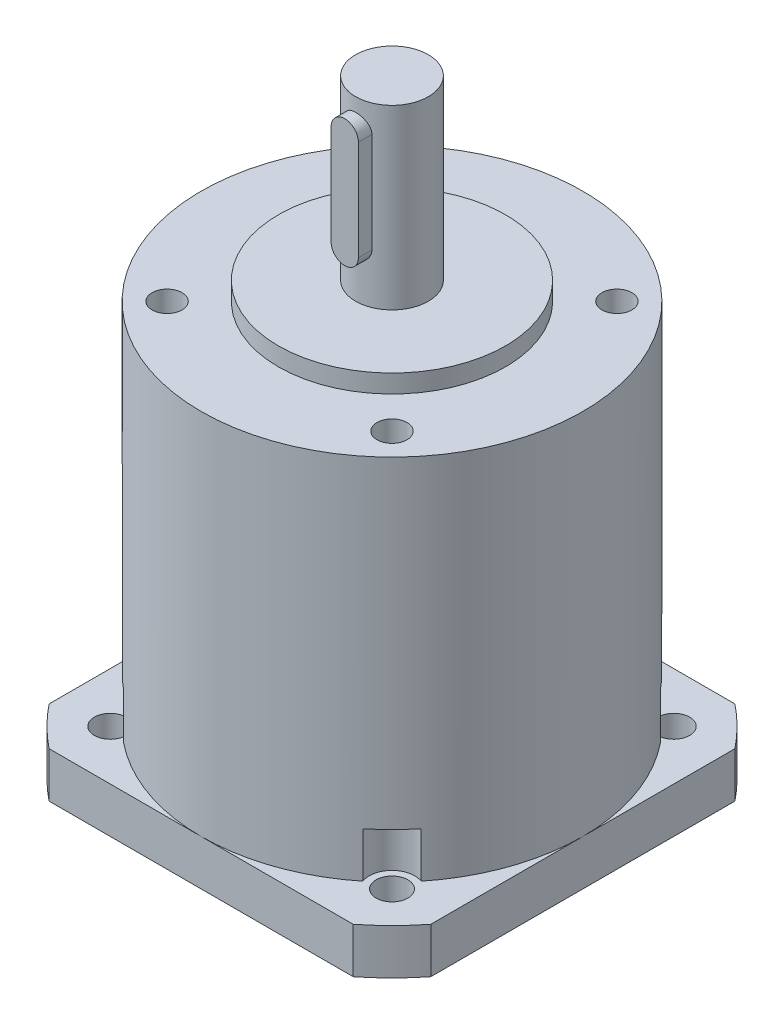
ISO-10303-21;
HEADER;
FILE_DESCRIPTION(('STEP AP214'),'2;1');
FILE_NAME('part.step','',(''),(''),'','','');
FILE_SCHEMA(('AUTOMOTIVE_DESIGN { 1 0 10303 214 1 1 1 1 }'));
ENDSEC;
DATA;
#1=APPLICATION_CONTEXT('core data for automotive mechanical design processes');
#2=APPLICATION_PROTOCOL_DEFINITION('international standard','automotive_design',2000,#1);
#3=PRODUCT_CONTEXT('',#1,'mechanical');
#4=PRODUCT('Part','Part','',(#3));
#5=PRODUCT_RELATED_PRODUCT_CATEGORY('part','',(#4));
#6=PRODUCT_DEFINITION_FORMATION('','',#4);
#7=PRODUCT_DEFINITION_CONTEXT('part definition',#1,'design');
#8=PRODUCT_DEFINITION('design','',#6,#7);
#9=PRODUCT_DEFINITION_SHAPE('','',#8);
#10=(LENGTH_UNIT() NAMED_UNIT(*) SI_UNIT(.MILLI.,.METRE.));
#11=(NAMED_UNIT(*) PLANE_ANGLE_UNIT() SI_UNIT($,.RADIAN.));
#12=(NAMED_UNIT(*) SI_UNIT($,.STERADIAN.) SOLID_ANGLE_UNIT());
#13=UNCERTAINTY_MEASURE_WITH_UNIT(LENGTH_MEASURE(1.E-05),#10,'distance_accuracy_value','');
#14=(GEOMETRIC_REPRESENTATION_CONTEXT(3) GLOBAL_UNCERTAINTY_ASSIGNED_CONTEXT((#13)) GLOBAL_UNIT_ASSIGNED_CONTEXT((#10,
#11,#12)) REPRESENTATION_CONTEXT('',''));
#15=CARTESIAN_POINT('',(0.,0.,0.));
#16=DIRECTION('',(0.,0.,1.));
#17=DIRECTION('',(1.,0.,0.));
#18=AXIS2_PLACEMENT_3D('',#15,#16,#17);
#19=CARTESIAN_POINT('',(0.,40.5,0.));
#20=DIRECTION('',(0.,-1.,0.));
#21=DIRECTION('',(0.,0.,-1.));
#22=AXIS2_PLACEMENT_3D('',#19,#20,#21);
#23=CYLINDRICAL_SURFACE('',#22,21.);
#24=CARTESIAN_POINT('',(0.,40.5,0.));
#25=DIRECTION('',(0.,1.,0.));
#26=DIRECTION('',(0.,0.,1.));
#27=AXIS2_PLACEMENT_3D('',#24,#25,#26);
#28=CIRCLE('',#27,21.);
#29=CARTESIAN_POINT('',(0.,40.5,21.));
#30=VERTEX_POINT('',#29);
#31=EDGE_CURVE('E235',#30,#30,#28,.T.);
#32=ORIENTED_EDGE('',*,*,#31,.F.);
#33=EDGE_LOOP('',(#32));
#34=FACE_BOUND('',#33,.T.);
#35=DIRECTION('',(0.,-1.,0.));
#36=VECTOR('',#35,1.);
#37=CARTESIAN_POINT('',(16.3684898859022,2.5,-13.1557036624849));
#38=LINE('',#37,#36);
#39=CARTESIAN_POINT('',(16.3684898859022,5.,-13.1557036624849));
#40=VERTEX_POINT('',#39);
#41=CARTESIAN_POINT('',(16.3684898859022,0.,-13.1557036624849));
#42=VERTEX_POINT('',#41);
#43=EDGE_CURVE('E199',#40,#42,#38,.T.);
#44=ORIENTED_EDGE('',*,*,#43,.F.);
#45=CARTESIAN_POINT('',(0.,5.,0.));
#46=DIRECTION('',(0.,-1.,0.));
#47=DIRECTION('',(0.,0.,-1.));
#48=AXIS2_PLACEMENT_3D('',#45,#46,#47);
#49=CIRCLE('',#48,21.);
#50=CARTESIAN_POINT('',(13.1557036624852,5.,-16.3684898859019));
#51=VERTEX_POINT('',#50);
#52=EDGE_CURVE('E314',#51,#40,#49,.T.);
#53=ORIENTED_EDGE('',*,*,#52,.F.);
#54=DIRECTION('',(0.,-1.,0.));
#55=VECTOR('',#54,1.);
#56=CARTESIAN_POINT('',(13.1557036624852,2.5,-16.3684898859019));
#57=LINE('',#56,#55);
#58=CARTESIAN_POINT('',(13.1557036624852,0.,-16.3684898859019));
#59=VERTEX_POINT('',#58);
#60=EDGE_CURVE('E210',#59,#51,#57,.F.);
#61=ORIENTED_EDGE('',*,*,#60,.F.);
#62=CARTESIAN_POINT('',(0.,0.,0.));
#63=DIRECTION('',(0.,1.,0.));
#64=DIRECTION('',(0.,0.,1.));
#65=AXIS2_PLACEMENT_3D('',#62,#63,#64);
#66=CIRCLE('',#65,21.);
#67=CARTESIAN_POINT('',(0.,0.,-21.));
#68=VERTEX_POINT('',#67);
#69=EDGE_CURVE('E220',#59,#68,#66,.T.);
#70=ORIENTED_EDGE('',*,*,#69,.T.);
#71=CARTESIAN_POINT('',(-13.155703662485,0.,-16.3684898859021));
#72=VERTEX_POINT('',#71);
#73=EDGE_CURVE('E228',#68,#72,#66,.T.);
#74=ORIENTED_EDGE('',*,*,#73,.T.);
#75=DIRECTION('',(0.,-1.,0.));
#76=VECTOR('',#75,1.);
#77=CARTESIAN_POINT('',(-13.155703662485,2.5,-16.3684898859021));
#78=LINE('',#77,#76);
#79=CARTESIAN_POINT('',(-13.155703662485,5.,-16.3684898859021));
#80=VERTEX_POINT('',#79);
#81=EDGE_CURVE('E606',#80,#72,#78,.T.);
#82=ORIENTED_EDGE('',*,*,#81,.F.);
#83=CARTESIAN_POINT('',(0.,5.,0.));
#84=DIRECTION('',(0.,-1.,0.));
#85=DIRECTION('',(0.,0.,-1.));
#86=AXIS2_PLACEMENT_3D('',#83,#84,#85);
#87=CIRCLE('',#86,21.);
#88=CARTESIAN_POINT('',(-16.3684898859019,5.,-13.1557036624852));
#89=VERTEX_POINT('',#88);
#90=EDGE_CURVE('E316',#89,#80,#87,.T.);
#91=ORIENTED_EDGE('',*,*,#90,.F.);
#92=DIRECTION('',(0.,-1.,0.));
#93=VECTOR('',#92,1.);
#94=CARTESIAN_POINT('',(-16.3684898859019,2.5,-13.1557036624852));
#95=LINE('',#94,#93);
#96=CARTESIAN_POINT('',(-16.3684898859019,0.,-13.1557036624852));
#97=VERTEX_POINT('',#96);
#98=EDGE_CURVE('E610',#97,#89,#95,.F.);
#99=ORIENTED_EDGE('',*,*,#98,.F.);
#100=CARTESIAN_POINT('',(-21.,0.,0.));
#101=VERTEX_POINT('',#100);
#102=EDGE_CURVE('E231',#97,#101,#66,.T.);
#103=ORIENTED_EDGE('',*,*,#102,.T.);
#104=CARTESIAN_POINT('',(-16.3684898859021,0.,13.155703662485));
#105=VERTEX_POINT('',#104);
#106=EDGE_CURVE('E229',#101,#105,#66,.T.);
#107=ORIENTED_EDGE('',*,*,#106,.T.);
#108=DIRECTION('',(0.,-1.,0.));
#109=VECTOR('',#108,1.);
#110=CARTESIAN_POINT('',(-16.3684898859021,2.5,13.155703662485));
#111=LINE('',#110,#109);
#112=CARTESIAN_POINT('',(-16.3684898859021,5.,13.155703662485));
#113=VERTEX_POINT('',#112);
#114=EDGE_CURVE('E331',#113,#105,#111,.T.);
#115=ORIENTED_EDGE('',*,*,#114,.F.);
#116=CARTESIAN_POINT('',(0.,5.,0.));
#117=DIRECTION('',(0.,-1.,0.));
#118=DIRECTION('',(0.,0.,-1.));
#119=AXIS2_PLACEMENT_3D('',#116,#117,#118);
#120=CIRCLE('',#119,21.);
#121=CARTESIAN_POINT('',(-13.1557036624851,5.,16.368489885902));
#122=VERTEX_POINT('',#121);
#123=EDGE_CURVE('E318',#122,#113,#120,.T.);
#124=ORIENTED_EDGE('',*,*,#123,.F.);
#125=DIRECTION('',(0.,-1.,0.));
#126=VECTOR('',#125,1.);
#127=CARTESIAN_POINT('',(-13.1557036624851,2.5,16.368489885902));
#128=LINE('',#127,#126);
#129=CARTESIAN_POINT('',(-13.1557036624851,0.,16.368489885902));
#130=VERTEX_POINT('',#129);
#131=EDGE_CURVE('E335',#130,#122,#128,.F.);
#132=ORIENTED_EDGE('',*,*,#131,.F.);
#133=CARTESIAN_POINT('',(0.,0.,21.));
#134=VERTEX_POINT('',#133);
#135=EDGE_CURVE('E230',#130,#134,#66,.T.);
#136=ORIENTED_EDGE('',*,*,#135,.T.);
#137=CARTESIAN_POINT('',(13.1557036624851,0.,16.368489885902));
#138=VERTEX_POINT('',#137);
#139=EDGE_CURVE('E227',#134,#138,#66,.T.);
#140=ORIENTED_EDGE('',*,*,#139,.T.);
#141=DIRECTION('',(0.,-1.,0.));
#142=VECTOR('',#141,1.);
#143=CARTESIAN_POINT('',(13.1557036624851,2.5,16.368489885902));
#144=LINE('',#143,#142);
#145=CARTESIAN_POINT('',(13.1557036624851,5.,16.368489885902));
#146=VERTEX_POINT('',#145);
#147=EDGE_CURVE('E46',#146,#138,#144,.T.);
#148=ORIENTED_EDGE('',*,*,#147,.F.);
#149=CARTESIAN_POINT('',(0.,5.,0.));
#150=DIRECTION('',(0.,-1.,0.));
#151=DIRECTION('',(0.,0.,-1.));
#152=AXIS2_PLACEMENT_3D('',#149,#150,#151);
#153=CIRCLE('',#152,21.);
#154=CARTESIAN_POINT('',(16.368489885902,5.,13.1557036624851));
#155=VERTEX_POINT('',#154);
#156=EDGE_CURVE('E307',#155,#146,#153,.T.);
#157=ORIENTED_EDGE('',*,*,#156,.F.);
#158=DIRECTION('',(0.,-1.,0.));
#159=VECTOR('',#158,1.);
#160=CARTESIAN_POINT('',(16.368489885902,2.5,13.1557036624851));
#161=LINE('',#160,#159);
#162=CARTESIAN_POINT('',(16.368489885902,0.,13.1557036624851));
#163=VERTEX_POINT('',#162);
#164=EDGE_CURVE('E11',#163,#155,#161,.F.);
#165=ORIENTED_EDGE('',*,*,#164,.F.);
#166=CARTESIAN_POINT('',(21.,0.,0.));
#167=VERTEX_POINT('',#166);
#168=EDGE_CURVE('E224',#163,#167,#66,.T.);
#169=ORIENTED_EDGE('',*,*,#168,.T.);
#170=EDGE_CURVE('E217',#167,#42,#66,.T.);
#171=ORIENTED_EDGE('',*,*,#170,.T.);
#172=EDGE_LOOP('',(#44,#53,#61,#70,#74,#82,#91,#99,#103,#107,#115,#124,#132,#136,#140,#148,#157,
#165,#169,#171));
#173=FACE_BOUND('',#172,.T.);
#174=ADVANCED_FACE('F39',(#34,#173),#23,.T.);
#175=CARTESIAN_POINT('',(15.4999999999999,5.,-15.5000000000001));
#176=DIRECTION('',(0.,-1.,0.));
#177=DIRECTION('',(0.,0.,-1.));
#178=AXIS2_PLACEMENT_3D('',#175,#176,#177);
#179=CYLINDRICAL_SURFACE('',#178,1.75);
#180=CARTESIAN_POINT('',(15.4999999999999,-5.,-15.5000000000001));
#181=DIRECTION('',(0.,-1.,0.));
#182=DIRECTION('',(0.,0.,-1.));
#183=AXIS2_PLACEMENT_3D('',#180,#181,#182);
#184=CIRCLE('',#183,1.75);
#185=CARTESIAN_POINT('',(15.4999999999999,-5.,-17.2500000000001));
#186=VERTEX_POINT('',#185);
#187=EDGE_CURVE('E349',#186,#186,#184,.T.);
#188=ORIENTED_EDGE('',*,*,#187,.T.);
#189=EDGE_LOOP('',(#188));
#190=FACE_BOUND('',#189,.T.);
#191=CARTESIAN_POINT('',(15.4999999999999,0.,-15.5000000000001));
#192=DIRECTION('',(0.,-1.,0.));
#193=DIRECTION('',(0.,0.,-1.));
#194=AXIS2_PLACEMENT_3D('',#191,#192,#193);
#195=CIRCLE('',#194,1.75);
#196=CARTESIAN_POINT('',(15.4999999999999,0.,-17.2500000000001));
#197=VERTEX_POINT('',#196);
#198=EDGE_CURVE('E352',#197,#197,#195,.T.);
#199=ORIENTED_EDGE('',*,*,#198,.F.);
#200=EDGE_LOOP('',(#199));
#201=FACE_BOUND('',#200,.T.);
#202=ADVANCED_FACE('F493',(#190,#201),#179,.F.);
#203=CARTESIAN_POINT('',(-15.5000000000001,5.,-15.4999999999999));
#204=DIRECTION('',(0.,-1.,0.));
#205=DIRECTION('',(0.,0.,-1.));
#206=AXIS2_PLACEMENT_3D('',#203,#204,#205);
#207=CYLINDRICAL_SURFACE('',#206,1.75);
#208=CARTESIAN_POINT('',(-15.5000000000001,-5.,-15.4999999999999));
#209=DIRECTION('',(0.,-1.,0.));
#210=DIRECTION('',(0.,0.,-1.));
#211=AXIS2_PLACEMENT_3D('',#208,#209,#210);
#212=CIRCLE('',#211,1.75);
#213=CARTESIAN_POINT('',(-15.5000000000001,-5.,-17.2499999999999));
#214=VERTEX_POINT('',#213);
#215=EDGE_CURVE('E343',#214,#214,#212,.T.);
#216=ORIENTED_EDGE('',*,*,#215,.T.);
#217=EDGE_LOOP('',(#216));
#218=FACE_BOUND('',#217,.T.);
#219=CARTESIAN_POINT('',(-15.5000000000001,0.,-15.4999999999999));
#220=DIRECTION('',(0.,-1.,0.));
#221=DIRECTION('',(0.,0.,-1.));
#222=AXIS2_PLACEMENT_3D('',#219,#220,#221);
#223=CIRCLE('',#222,1.75);
#224=CARTESIAN_POINT('',(-15.5000000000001,0.,-17.2499999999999));
#225=VERTEX_POINT('',#224);
#226=EDGE_CURVE('E346',#225,#225,#223,.T.);
#227=ORIENTED_EDGE('',*,*,#226,.F.);
#228=EDGE_LOOP('',(#227));
#229=FACE_BOUND('',#228,.T.);
#230=ADVANCED_FACE('F498',(#218,#229),#207,.F.);
#231=CARTESIAN_POINT('',(-15.4999999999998,5.,15.5000000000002));
#232=DIRECTION('',(0.,-1.,0.));
#233=DIRECTION('',(0.,0.,-1.));
#234=AXIS2_PLACEMENT_3D('',#231,#232,#233);
#235=CYLINDRICAL_SURFACE('',#234,1.75);
#236=CARTESIAN_POINT('',(-15.4999999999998,-5.,15.5000000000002));
#237=DIRECTION('',(0.,-1.,0.));
#238=DIRECTION('',(0.,0.,-1.));
#239=AXIS2_PLACEMENT_3D('',#236,#237,#238);
#240=CIRCLE('',#239,1.75);
#241=CARTESIAN_POINT('',(-15.4999999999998,-5.,13.7500000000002));
#242=VERTEX_POINT('',#241);
#243=EDGE_CURVE('E333',#242,#242,#240,.T.);
#244=ORIENTED_EDGE('',*,*,#243,.T.);
#245=EDGE_LOOP('',(#244));
#246=FACE_BOUND('',#245,.T.);
#247=CARTESIAN_POINT('',(-15.4999999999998,0.,15.5000000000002));
#248=DIRECTION('',(0.,-1.,0.));
#249=DIRECTION('',(0.,0.,-1.));
#250=AXIS2_PLACEMENT_3D('',#247,#248,#249);
#251=CIRCLE('',#250,1.75);
#252=CARTESIAN_POINT('',(-15.4999999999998,0.,13.7500000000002));
#253=VERTEX_POINT('',#252);
#254=EDGE_CURVE('E340',#253,#253,#251,.T.);
#255=ORIENTED_EDGE('',*,*,#254,.F.);
#256=EDGE_LOOP('',(#255));
#257=FACE_BOUND('',#256,.T.);
#258=ADVANCED_FACE('F504',(#246,#257),#235,.F.);
#259=CARTESIAN_POINT('',(15.5,5.,15.5));
#260=DIRECTION('',(0.,-1.,0.));
#261=DIRECTION('',(0.,0.,-1.));
#262=AXIS2_PLACEMENT_3D('',#259,#260,#261);
#263=CYLINDRICAL_SURFACE('',#262,1.75);
#264=CARTESIAN_POINT('',(15.5,-5.,15.5));
#265=DIRECTION('',(0.,-1.,0.));
#266=DIRECTION('',(0.,0.,-1.));
#267=AXIS2_PLACEMENT_3D('',#264,#265,#266);
#268=CIRCLE('',#267,1.75);
#269=CARTESIAN_POINT('',(15.5,-5.,13.75));
#270=VERTEX_POINT('',#269);
#271=EDGE_CURVE('E355',#270,#270,#268,.T.);
#272=ORIENTED_EDGE('',*,*,#271,.T.);
#273=EDGE_LOOP('',(#272));
#274=FACE_BOUND('',#273,.T.);
#275=CARTESIAN_POINT('',(15.5,0.,15.5));
#276=DIRECTION('',(0.,-1.,0.));
#277=DIRECTION('',(0.,0.,-1.));
#278=AXIS2_PLACEMENT_3D('',#275,#276,#277);
#279=CIRCLE('',#278,1.75);
#280=CARTESIAN_POINT('',(15.5,0.,13.75));
#281=VERTEX_POINT('',#280);
#282=EDGE_CURVE('E358',#281,#281,#279,.T.);
#283=ORIENTED_EDGE('',*,*,#282,.F.);
#284=EDGE_LOOP('',(#283));
#285=FACE_BOUND('',#284,.T.);
#286=ADVANCED_FACE('F516',(#274,#285),#263,.F.);
#287=CARTESIAN_POINT('',(0.,0.,0.));
#288=DIRECTION('',(0.,-1.,0.));
#289=DIRECTION('',(0.,0.,-1.));
#290=AXIS2_PLACEMENT_3D('',#287,#288,#289);
#291=PLANE('',#290);
#292=ORIENTED_EDGE('',*,*,#282,.T.);
#293=EDGE_LOOP('',(#292));
#294=FACE_BOUND('',#293,.T.);
#295=CARTESIAN_POINT('',(15.5,0.,15.5));
#296=DIRECTION('',(0.,1.,0.));
#297=DIRECTION('',(0.,0.,1.));
#298=AXIS2_PLACEMENT_3D('',#295,#296,#297);
#299=CIRCLE('',#298,2.5);
#300=EDGE_CURVE('E324',#163,#138,#299,.T.);
#301=ORIENTED_EDGE('',*,*,#300,.T.);
#302=ORIENTED_EDGE('',*,*,#139,.F.);
#303=DIRECTION('',(1.,0.,0.));
#304=VECTOR('',#303,1.);
#305=CARTESIAN_POINT('',(-21.,0.,21.));
#306=LINE('',#305,#304);
#307=CARTESIAN_POINT('',(16.7308846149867,0.,21.));
#308=VERTEX_POINT('',#307);
#309=EDGE_CURVE('E422',#134,#308,#306,.T.);
#310=ORIENTED_EDGE('',*,*,#309,.T.);
#311=CARTESIAN_POINT('',(0.,0.,0.));
#312=DIRECTION('',(0.,1.,0.));
#313=DIRECTION('',(0.,0.,1.));
#314=AXIS2_PLACEMENT_3D('',#311,#312,#313);
#315=CIRCLE('',#314,26.85);
#316=CARTESIAN_POINT('',(21.,0.,16.7308846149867));
#317=VERTEX_POINT('',#316);
#318=EDGE_CURVE('E369',#308,#317,#315,.T.);
#319=ORIENTED_EDGE('',*,*,#318,.T.);
#320=DIRECTION('',(0.,0.,-1.));
#321=VECTOR('',#320,1.);
#322=CARTESIAN_POINT('',(21.,0.,21.));
#323=LINE('',#322,#321);
#324=EDGE_CURVE('E413',#317,#167,#323,.T.);
#325=ORIENTED_EDGE('',*,*,#324,.T.);
#326=ORIENTED_EDGE('',*,*,#168,.F.);
#327=EDGE_LOOP('',(#301,#302,#310,#319,#325,#326));
#328=FACE_BOUND('',#327,.T.);
#329=ADVANCED_FACE('F329',(#294,#328),#291,.F.);
#330=ORIENTED_EDGE('',*,*,#198,.T.);
#331=EDGE_LOOP('',(#330));
#332=FACE_BOUND('',#331,.T.);
#333=CARTESIAN_POINT('',(15.5000000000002,0.,-15.4999999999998));
#334=DIRECTION('',(0.,1.,0.));
#335=DIRECTION('',(0.,0.,1.));
#336=AXIS2_PLACEMENT_3D('',#333,#334,#335);
#337=CIRCLE('',#336,2.5);
#338=EDGE_CURVE('E203',#59,#42,#337,.T.);
#339=ORIENTED_EDGE('',*,*,#338,.T.);
#340=ORIENTED_EDGE('',*,*,#170,.F.);
#341=CARTESIAN_POINT('',(21.,0.,-16.7308846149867));
#342=VERTEX_POINT('',#341);
#343=EDGE_CURVE('E398',#167,#342,#323,.T.);
#344=ORIENTED_EDGE('',*,*,#343,.T.);
#345=CARTESIAN_POINT('',(16.7308846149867,0.,-21.));
#346=VERTEX_POINT('',#345);
#347=EDGE_CURVE('E373',#342,#346,#315,.T.);
#348=ORIENTED_EDGE('',*,*,#347,.T.);
#349=DIRECTION('',(-1.,0.,0.));
#350=VECTOR('',#349,1.);
#351=CARTESIAN_POINT('',(-21.,0.,-21.));
#352=LINE('',#351,#350);
#353=EDGE_CURVE('E416',#346,#68,#352,.T.);
#354=ORIENTED_EDGE('',*,*,#353,.T.);
#355=ORIENTED_EDGE('',*,*,#69,.F.);
#356=EDGE_LOOP('',(#339,#340,#344,#348,#354,#355));
#357=FACE_BOUND('',#356,.T.);
#358=ADVANCED_FACE('F215',(#332,#357),#291,.F.);
#359=ORIENTED_EDGE('',*,*,#226,.T.);
#360=EDGE_LOOP('',(#359));
#361=FACE_BOUND('',#360,.T.);
#362=CARTESIAN_POINT('',(-15.4999999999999,0.,-15.5000000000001));
#363=DIRECTION('',(0.,1.,0.));
#364=DIRECTION('',(0.,0.,1.));
#365=AXIS2_PLACEMENT_3D('',#362,#363,#364);
#366=CIRCLE('',#365,2.5);
#367=EDGE_CURVE('E209',#97,#72,#366,.T.);
#368=ORIENTED_EDGE('',*,*,#367,.T.);
#369=ORIENTED_EDGE('',*,*,#73,.F.);
#370=CARTESIAN_POINT('',(-16.7308846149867,0.,-21.));
#371=VERTEX_POINT('',#370);
#372=EDGE_CURVE('E415',#68,#371,#352,.T.);
#373=ORIENTED_EDGE('',*,*,#372,.T.);
#374=CARTESIAN_POINT('',(-21.,0.,-16.7308846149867));
#375=VERTEX_POINT('',#374);
#376=EDGE_CURVE('E366',#371,#375,#315,.T.);
#377=ORIENTED_EDGE('',*,*,#376,.T.);
#378=DIRECTION('',(0.,0.,1.));
#379=VECTOR('',#378,1.);
#380=CARTESIAN_POINT('',(-21.,0.,21.));
#381=LINE('',#380,#379);
#382=EDGE_CURVE('E419',#375,#101,#381,.T.);
#383=ORIENTED_EDGE('',*,*,#382,.T.);
#384=ORIENTED_EDGE('',*,*,#102,.F.);
#385=EDGE_LOOP('',(#368,#369,#373,#377,#383,#384));
#386=FACE_BOUND('',#385,.T.);
#387=ADVANCED_FACE('F561',(#361,#386),#291,.F.);
#388=CARTESIAN_POINT('',(21.,-5.,21.));
#389=DIRECTION('',(1.,0.,0.));
#390=DIRECTION('',(0.,0.,-1.));
#391=AXIS2_PLACEMENT_3D('',#388,#389,#390);
#392=PLANE('',#391);
#393=DIRECTION('',(0.,0.,-1.));
#394=VECTOR('',#393,1.);
#395=CARTESIAN_POINT('',(21.,-5.,21.));
#396=LINE('',#395,#394);
#397=CARTESIAN_POINT('',(21.,-5.,16.7308846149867));
#398=VERTEX_POINT('',#397);
#399=CARTESIAN_POINT('',(21.,-5.,-16.7308846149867));
#400=VERTEX_POINT('',#399);
#401=EDGE_CURVE('E399',#398,#400,#396,.T.);
#402=ORIENTED_EDGE('',*,*,#401,.T.);
#403=DIRECTION('',(0.,1.,0.));
#404=VECTOR('',#403,1.);
#405=CARTESIAN_POINT('',(21.,-5.5,-16.7308846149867));
#406=LINE('',#405,#404);
#407=EDGE_CURVE('E395',#400,#342,#406,.T.);
#408=ORIENTED_EDGE('',*,*,#407,.T.);
#409=ORIENTED_EDGE('',*,*,#343,.F.);
#410=ORIENTED_EDGE('',*,*,#324,.F.);
#411=DIRECTION('',(0.,1.,0.));
#412=VECTOR('',#411,1.);
#413=CARTESIAN_POINT('',(21.,-5.5,16.7308846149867));
#414=LINE('',#413,#412);
#415=EDGE_CURVE('E389',#317,#398,#414,.F.);
#416=ORIENTED_EDGE('',*,*,#415,.T.);
#417=EDGE_LOOP('',(#402,#408,#409,#410,#416));
#418=FACE_BOUND('',#417,.T.);
#419=ADVANCED_FACE('F552',(#418),#392,.T.);
#420=CARTESIAN_POINT('',(-21.,-5.,21.));
#421=DIRECTION('',(0.,0.,1.));
#422=DIRECTION('',(1.,0.,0.));
#423=AXIS2_PLACEMENT_3D('',#420,#421,#422);
#424=PLANE('',#423);
#425=DIRECTION('',(1.,0.,0.));
#426=VECTOR('',#425,1.);
#427=CARTESIAN_POINT('',(-21.,-5.,21.));
#428=LINE('',#427,#426);
#429=CARTESIAN_POINT('',(-16.7308846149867,-5.,21.));
#430=VERTEX_POINT('',#429);
#431=CARTESIAN_POINT('',(16.7308846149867,-5.,21.));
#432=VERTEX_POINT('',#431);
#433=EDGE_CURVE('E409',#430,#432,#428,.T.);
#434=ORIENTED_EDGE('',*,*,#433,.T.);
#435=DIRECTION('',(0.,1.,0.));
#436=VECTOR('',#435,1.);
#437=CARTESIAN_POINT('',(16.7308846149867,-5.5,21.));
#438=LINE('',#437,#436);
#439=EDGE_CURVE('E61',#432,#308,#438,.T.);
#440=ORIENTED_EDGE('',*,*,#439,.T.);
#441=ORIENTED_EDGE('',*,*,#309,.F.);
#442=CARTESIAN_POINT('',(-16.7308846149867,0.,21.));
#443=VERTEX_POINT('',#442);
#444=EDGE_CURVE('E403',#443,#134,#306,.T.);
#445=ORIENTED_EDGE('',*,*,#444,.F.);
#446=DIRECTION('',(0.,1.,0.));
#447=VECTOR('',#446,1.);
#448=CARTESIAN_POINT('',(-16.7308846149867,-5.5,21.));
#449=LINE('',#448,#447);
#450=EDGE_CURVE('E384',#443,#430,#449,.F.);
#451=ORIENTED_EDGE('',*,*,#450,.T.);
#452=EDGE_LOOP('',(#434,#440,#441,#445,#451));
#453=FACE_BOUND('',#452,.T.);
#454=ADVANCED_FACE('F548',(#453),#424,.T.);
#455=CARTESIAN_POINT('',(-21.,-5.,21.));
#456=DIRECTION('',(-1.,0.,0.));
#457=DIRECTION('',(0.,0.,1.));
#458=AXIS2_PLACEMENT_3D('',#455,#456,#457);
#459=PLANE('',#458);
#460=DIRECTION('',(0.,0.,1.));
#461=VECTOR('',#460,1.);
#462=CARTESIAN_POINT('',(-21.,-5.,21.));
#463=LINE('',#462,#461);
#464=CARTESIAN_POINT('',(-21.,-5.,-16.7308846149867));
#465=VERTEX_POINT('',#464);
#466=CARTESIAN_POINT('',(-21.,-5.,16.7308846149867));
#467=VERTEX_POINT('',#466);
#468=EDGE_CURVE('E406',#465,#467,#463,.T.);
#469=ORIENTED_EDGE('',*,*,#468,.T.);
#470=DIRECTION('',(0.,1.,0.));
#471=VECTOR('',#470,1.);
#472=CARTESIAN_POINT('',(-21.,-5.5,16.7308846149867));
#473=LINE('',#472,#471);
#474=CARTESIAN_POINT('',(-21.,0.,16.7308846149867));
#475=VERTEX_POINT('',#474);
#476=EDGE_CURVE('E381',#467,#475,#473,.T.);
#477=ORIENTED_EDGE('',*,*,#476,.T.);
#478=EDGE_CURVE('E418',#101,#475,#381,.T.);
#479=ORIENTED_EDGE('',*,*,#478,.F.);
#480=ORIENTED_EDGE('',*,*,#382,.F.);
#481=DIRECTION('',(0.,1.,0.));
#482=VECTOR('',#481,1.);
#483=CARTESIAN_POINT('',(-21.,-5.5,-16.7308846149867));
#484=LINE('',#483,#482);
#485=EDGE_CURVE('E378',#375,#465,#484,.F.);
#486=ORIENTED_EDGE('',*,*,#485,.T.);
#487=EDGE_LOOP('',(#469,#477,#479,#480,#486));
#488=FACE_BOUND('',#487,.T.);
#489=ADVANCED_FACE('F551',(#488),#459,.T.);
#490=CARTESIAN_POINT('',(-21.,-5.,-21.));
#491=DIRECTION('',(0.,0.,-1.));
#492=DIRECTION('',(-1.,0.,0.));
#493=AXIS2_PLACEMENT_3D('',#490,#491,#492);
#494=PLANE('',#493);
#495=DIRECTION('',(-1.,0.,0.));
#496=VECTOR('',#495,1.);
#497=CARTESIAN_POINT('',(-21.,-5.,-21.));
#498=LINE('',#497,#496);
#499=CARTESIAN_POINT('',(16.7308846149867,-5.,-21.));
#500=VERTEX_POINT('',#499);
#501=CARTESIAN_POINT('',(-16.7308846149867,-5.,-21.));
#502=VERTEX_POINT('',#501);
#503=EDGE_CURVE('E402',#500,#502,#498,.T.);
#504=ORIENTED_EDGE('',*,*,#503,.T.);
#505=DIRECTION('',(0.,1.,0.));
#506=VECTOR('',#505,1.);
#507=CARTESIAN_POINT('',(-16.7308846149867,-5.5,-21.));
#508=LINE('',#507,#506);
#509=EDGE_CURVE('E53',#502,#371,#508,.T.);
#510=ORIENTED_EDGE('',*,*,#509,.T.);
#511=ORIENTED_EDGE('',*,*,#372,.F.);
#512=ORIENTED_EDGE('',*,*,#353,.F.);
#513=DIRECTION('',(0.,1.,0.));
#514=VECTOR('',#513,1.);
#515=CARTESIAN_POINT('',(16.7308846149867,-5.5,-21.));
#516=LINE('',#515,#514);
#517=EDGE_CURVE('E392',#346,#500,#516,.F.);
#518=ORIENTED_EDGE('',*,*,#517,.T.);
#519=EDGE_LOOP('',(#504,#510,#511,#512,#518));
#520=FACE_BOUND('',#519,.T.);
#521=ADVANCED_FACE('F543',(#520),#494,.T.);
#522=CARTESIAN_POINT('',(0.,-5.,0.));
#523=DIRECTION('',(0.,-1.,0.));
#524=DIRECTION('',(0.,0.,-1.));
#525=AXIS2_PLACEMENT_3D('',#522,#523,#524);
#526=PLANE('',#525);
#527=ORIENTED_EDGE('',*,*,#243,.F.);
#528=EDGE_LOOP('',(#527));
#529=FACE_BOUND('',#528,.T.);
#530=ORIENTED_EDGE('',*,*,#215,.F.);
#531=EDGE_LOOP('',(#530));
#532=FACE_BOUND('',#531,.T.);
#533=ORIENTED_EDGE('',*,*,#187,.F.);
#534=EDGE_LOOP('',(#533));
#535=FACE_BOUND('',#534,.T.);
#536=ORIENTED_EDGE('',*,*,#271,.F.);
#537=EDGE_LOOP('',(#536));
#538=FACE_BOUND('',#537,.T.);
#539=CARTESIAN_POINT('',(0.,-5.,0.));
#540=DIRECTION('',(0.,-1.,0.));
#541=DIRECTION('',(0.,0.,-1.));
#542=AXIS2_PLACEMENT_3D('',#539,#540,#541);
#543=CIRCLE('',#542,11.);
#544=CARTESIAN_POINT('',(0.,-5.,-11.));
#545=VERTEX_POINT('',#544);
#546=EDGE_CURVE('E311',#545,#545,#543,.T.);
#547=ORIENTED_EDGE('',*,*,#546,.F.);
#548=EDGE_LOOP('',(#547));
#549=FACE_BOUND('',#548,.T.);
#550=ORIENTED_EDGE('',*,*,#503,.F.);
#551=CARTESIAN_POINT('',(0.,-5.,0.));
#552=DIRECTION('',(0.,-1.,0.));
#553=DIRECTION('',(0.,0.,-1.));
#554=AXIS2_PLACEMENT_3D('',#551,#552,#553);
#555=CIRCLE('',#554,26.85);
#556=EDGE_CURVE('E375',#500,#400,#555,.T.);
#557=ORIENTED_EDGE('',*,*,#556,.T.);
#558=ORIENTED_EDGE('',*,*,#401,.F.);
#559=EDGE_CURVE('E387',#398,#432,#555,.T.);
#560=ORIENTED_EDGE('',*,*,#559,.T.);
#561=ORIENTED_EDGE('',*,*,#433,.F.);
#562=EDGE_CURVE('E376',#430,#467,#555,.T.);
#563=ORIENTED_EDGE('',*,*,#562,.T.);
#564=ORIENTED_EDGE('',*,*,#468,.F.);
#565=EDGE_CURVE('E372',#465,#502,#555,.T.);
#566=ORIENTED_EDGE('',*,*,#565,.T.);
#567=EDGE_LOOP('',(#550,#557,#558,#560,#561,#563,#564,#566));
#568=FACE_BOUND('',#567,.T.);
#569=ADVANCED_FACE('F540',(#529,#532,#535,#538,#549,#568),#526,.T.);
#570=ORIENTED_EDGE('',*,*,#254,.T.);
#571=EDGE_LOOP('',(#570));
#572=FACE_BOUND('',#571,.T.);
#573=CARTESIAN_POINT('',(-15.5000000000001,0.,15.4999999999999));
#574=DIRECTION('',(0.,1.,0.));
#575=DIRECTION('',(0.,0.,1.));
#576=AXIS2_PLACEMENT_3D('',#573,#574,#575);
#577=CIRCLE('',#576,2.5);
#578=EDGE_CURVE('E602',#130,#105,#577,.T.);
#579=ORIENTED_EDGE('',*,*,#578,.T.);
#580=ORIENTED_EDGE('',*,*,#106,.F.);
#581=ORIENTED_EDGE('',*,*,#478,.T.);
#582=CARTESIAN_POINT('',(0.,0.,0.));
#583=DIRECTION('',(0.,-1.,0.));
#584=DIRECTION('',(0.,0.,-1.));
#585=AXIS2_PLACEMENT_3D('',#582,#583,#584);
#586=CIRCLE('',#585,26.85);
#587=EDGE_CURVE('E305',#443,#475,#586,.T.);
#588=ORIENTED_EDGE('',*,*,#587,.F.);
#589=ORIENTED_EDGE('',*,*,#444,.T.);
#590=ORIENTED_EDGE('',*,*,#135,.F.);
#591=EDGE_LOOP('',(#579,#580,#581,#588,#589,#590));
#592=FACE_BOUND('',#591,.T.);
#593=ADVANCED_FACE('F476',(#572,#592),#291,.F.);
#594=CARTESIAN_POINT('',(0.,62.,0.));
#595=DIRECTION('',(0.,-1.,0.));
#596=DIRECTION('',(0.,0.,-1.));
#597=AXIS2_PLACEMENT_3D('',#594,#595,#596);
#598=CYLINDRICAL_SURFACE('',#597,4.);
#599=CARTESIAN_POINT('',(0.,62.,0.));
#600=DIRECTION('',(0.,1.,0.));
#601=DIRECTION('',(0.,0.,1.));
#602=AXIS2_PLACEMENT_3D('',#599,#600,#601);
#603=CIRCLE('',#602,4.);
#604=CARTESIAN_POINT('',(0.,62.,4.));
#605=VERTEX_POINT('',#604);
#606=EDGE_CURVE('E255',#605,#605,#603,.T.);
#607=ORIENTED_EDGE('',*,*,#606,.F.);
#608=EDGE_LOOP('',(#607));
#609=FACE_BOUND('',#608,.T.);
#610=CARTESIAN_POINT('',(0.,42.5,0.));
#611=DIRECTION('',(0.,1.,0.));
#612=DIRECTION('',(0.,0.,1.));
#613=AXIS2_PLACEMENT_3D('',#610,#611,#612);
#614=CIRCLE('',#613,4.);
#615=CARTESIAN_POINT('',(0.,42.5,4.));
#616=VERTEX_POINT('',#615);
#617=EDGE_CURVE('E252',#616,#616,#614,.F.);
#618=ORIENTED_EDGE('',*,*,#617,.F.);
#619=EDGE_LOOP('',(#618));
#620=FACE_BOUND('',#619,.T.);
#621=CARTESIAN_POINT('',(-1.5,48.,3.70809924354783));
#622=CARTESIAN_POINT('',(-1.50000304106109,47.9189925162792,3.70809640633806));
#623=CARTESIAN_POINT('',(-1.49341597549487,47.8380050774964,3.71078260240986));
#624=CARTESIAN_POINT('',(-1.46736187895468,47.6784719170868,3.72116159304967));
#625=CARTESIAN_POINT('',(-1.44789523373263,47.599926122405,3.72885423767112));
#626=CARTESIAN_POINT('',(-1.39689657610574,47.4476246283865,3.748254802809));
#627=CARTESIAN_POINT('',(-1.36539347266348,47.3738579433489,3.7599530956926));
#628=CARTESIAN_POINT('',(-1.29131856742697,47.2326281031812,3.78603134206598));
#629=CARTESIAN_POINT('',(-1.24874344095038,47.1651668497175,3.80041210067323));
#630=CARTESIAN_POINT('',(-1.15146661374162,47.0351096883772,3.83103574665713));
#631=CARTESIAN_POINT('',(-1.09630381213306,46.9728714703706,3.84733341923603));
#632=CARTESIAN_POINT('',(-0.976395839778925,46.8582771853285,3.87949750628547));
#633=CARTESIAN_POINT('',(-0.91164863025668,46.8059232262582,3.89536382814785));
#634=CARTESIAN_POINT('',(-0.771694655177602,46.7108604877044,3.92552873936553));
#635=CARTESIAN_POINT('',(-0.69620694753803,46.6685405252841,3.93975561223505));
#636=CARTESIAN_POINT('',(-0.538555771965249,46.5973488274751,3.96438007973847));
#637=CARTESIAN_POINT('',(-0.456394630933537,46.568472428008,3.97477900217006));
#638=CARTESIAN_POINT('',(-0.291489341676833,46.5262421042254,3.99018697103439));
#639=CARTESIAN_POINT('',(-0.208923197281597,46.5122723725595,3.99540915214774));
#640=CARTESIAN_POINT('',(-0.042464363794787,46.498278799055,4.0006401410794));
#641=CARTESIAN_POINT('',(0.0414278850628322,46.4982504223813,4.00065064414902));
#642=CARTESIAN_POINT('',(0.203743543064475,46.5117817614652,3.99559265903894));
#643=CARTESIAN_POINT('',(0.282232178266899,46.5246692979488,3.99077541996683));
#644=CARTESIAN_POINT('',(0.435839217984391,46.5625359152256,3.97693274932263));
#645=CARTESIAN_POINT('',(0.510957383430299,46.587515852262,3.96790701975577));
#646=CARTESIAN_POINT('',(0.656989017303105,46.6491704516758,3.9463776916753));
#647=CARTESIAN_POINT('',(0.727825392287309,46.6860100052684,3.93382539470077));
#648=CARTESIAN_POINT('',(0.862486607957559,46.7701920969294,3.90651310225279));
#649=CARTESIAN_POINT('',(0.926309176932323,46.8175380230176,3.8917523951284));
#650=CARTESIAN_POINT('',(1.04909048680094,46.9246272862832,3.86052529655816));
#651=CARTESIAN_POINT('',(1.10754614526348,46.9849339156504,3.84400963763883));
#652=CARTESIAN_POINT('',(1.21370395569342,47.1145929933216,3.81182460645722));
#653=CARTESIAN_POINT('',(1.261403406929,47.1839477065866,3.79615544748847));
#654=CARTESIAN_POINT('',(1.34565611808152,47.3317194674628,3.76712703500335));
#655=CARTESIAN_POINT('',(1.38193847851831,47.4103034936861,3.75382677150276));
#656=CARTESIAN_POINT('',(1.44056464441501,47.5730962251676,3.73172438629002));
#657=CARTESIAN_POINT('',(1.46291620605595,47.6573017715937,3.72291976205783));
#658=CARTESIAN_POINT('',(1.49190191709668,47.823975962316,3.71139597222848));
#659=CARTESIAN_POINT('',(1.49933521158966,47.9062841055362,3.70836785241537));
#660=CARTESIAN_POINT('',(1.50057885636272,48.0710093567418,3.70786539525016));
#661=CARTESIAN_POINT('',(1.49439261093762,48.1534264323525,3.71038967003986));
#662=CARTESIAN_POINT('',(1.46929733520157,48.3119299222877,3.72039381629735));
#663=CARTESIAN_POINT('',(1.45100618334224,48.3881311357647,3.72763276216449));
#664=CARTESIAN_POINT('',(1.40299774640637,48.5363479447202,3.74596487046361));
#665=CARTESIAN_POINT('',(1.37327812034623,48.6083626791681,3.75705882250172));
#666=CARTESIAN_POINT('',(1.30200292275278,48.7491644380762,3.7823624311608));
#667=CARTESIAN_POINT('',(1.26004545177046,48.8177292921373,3.79667328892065));
#668=CARTESIAN_POINT('',(1.16591317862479,48.947128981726,3.82662814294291));
#669=CARTESIAN_POINT('',(1.11373463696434,49.0079609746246,3.84227262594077));
#670=CARTESIAN_POINT('',(0.996727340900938,49.1241683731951,3.87433046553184));
#671=CARTESIAN_POINT('',(0.93130634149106,49.1789534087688,3.89072969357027));
#672=CARTESIAN_POINT('',(0.79179747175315,49.2768383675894,3.92149874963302));
#673=CARTESIAN_POINT('',(0.717709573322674,49.3199382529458,3.93586857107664));
#674=CARTESIAN_POINT('',(0.563016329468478,49.3929460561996,3.96094985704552));
#675=CARTESIAN_POINT('',(0.482434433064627,49.4228991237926,3.9716738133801));
#676=CARTESIAN_POINT('',(0.316881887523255,49.4686564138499,3.98829436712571));
#677=CARTESIAN_POINT('',(0.231913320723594,49.4844672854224,3.99419323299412));
#678=CARTESIAN_POINT('',(0.0653355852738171,49.5007744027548,4.00028407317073));
#679=CARTESIAN_POINT('',(-0.0161807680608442,49.502109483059,4.00078860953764));
#680=CARTESIAN_POINT('',(-0.178226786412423,49.4915848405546,3.99684889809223));
#681=CARTESIAN_POINT('',(-0.258756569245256,49.4797267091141,3.9924052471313));
#682=CARTESIAN_POINT('',(-0.414548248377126,49.4437411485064,3.97921089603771));
#683=CARTESIAN_POINT('',(-0.489890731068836,49.4199200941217,3.97056791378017));
#684=CARTESIAN_POINT('',(-0.635515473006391,49.3609899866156,3.9498778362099));
#685=CARTESIAN_POINT('',(-0.705796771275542,49.3258787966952,3.93783009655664));
#686=CARTESIAN_POINT('',(-0.84254017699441,49.2436860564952,3.91090618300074));
#687=CARTESIAN_POINT('',(-0.908717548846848,49.1961633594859,3.89593240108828));
#688=CARTESIAN_POINT('',(-1.03241734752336,49.0911921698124,3.86499507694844));
#689=CARTESIAN_POINT('',(-1.0899366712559,49.0337401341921,3.84903118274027));
#690=CARTESIAN_POINT('',(-1.19781214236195,48.9069358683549,3.81688129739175));
#691=CARTESIAN_POINT('',(-1.24762999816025,48.8371155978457,3.8007280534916));
#692=CARTESIAN_POINT('',(-1.33484709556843,48.6895841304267,3.77098325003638));
#693=CARTESIAN_POINT('',(-1.37224504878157,48.6118721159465,3.75739195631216));
#694=CARTESIAN_POINT('',(-1.4346588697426,48.4470443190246,3.73402269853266));
#695=CARTESIAN_POINT('',(-1.45906002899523,48.3596656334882,3.7244380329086));
#696=CARTESIAN_POINT('',(-1.49172356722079,48.1815147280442,3.71147994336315));
#697=CARTESIAN_POINT('',(-1.4999965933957,48.09074478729,3.70810242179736));
#698=CARTESIAN_POINT('',(-1.5,48.,3.70809924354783));
#699=B_SPLINE_CURVE_WITH_KNOTS('',3,(#621,#622,#623,#624,#625,#626,#627,#628,#629,#630,#631,
#632,#633,#634,#635,#636,#637,#638,#639,#640,#641,#642,#643,#644,#645,#646,#647,#648,#649,#650,
#651,#652,#653,#654,#655,#656,#657,#658,#659,#660,#661,#662,#663,#664,#665,#666,#667,#668,#669,
#670,#671,#672,#673,#674,#675,#676,#677,#678,#679,#680,#681,#682,#683,#684,#685,#686,#687,#688,
#689,#690,#691,#692,#693,#694,#695,#696,#697,#698),.UNSPECIFIED.,.T.,.F.,(4,2,2,2,2,2,2,2,2,2,2,
2,2,2,2,2,2,2,2,2,2,2,2,2,2,2,2,2,2,2,2,2,2,2,2,2,2,2,4),(0.,0.242684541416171,
0.485361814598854,0.727459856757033,0.969630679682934,1.22274652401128,1.47591628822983,
1.73770072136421,1.9993942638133,2.24980018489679,2.50012465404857,2.73806472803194,
2.97602165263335,3.21744131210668,3.45893893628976,3.71456675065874,3.97025867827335,
4.23162592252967,4.49284751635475,4.73965657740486,4.98640395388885,5.22143845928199,
5.45652113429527,5.70041561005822,5.94439948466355,6.20385016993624,6.46330169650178,
6.72185508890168,6.98028685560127,7.22365720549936,7.4669982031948,7.70440274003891,
7.94185223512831,8.18928323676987,8.43680270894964,8.6973859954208,8.95799630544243,
9.23003178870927,9.50188762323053),.UNSPECIFIED.);
#700=CARTESIAN_POINT('',(-1.5,48.,3.70809924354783));
#701=VERTEX_POINT('',#700);
#702=CARTESIAN_POINT('',(1.5,48.,3.70809924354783));
#703=VERTEX_POINT('',#702);
#704=EDGE_CURVE('E300',#701,#703,#699,.T.);
#705=ORIENTED_EDGE('',*,*,#704,.F.);
#706=DIRECTION('',(0.,-1.,0.));
#707=VECTOR('',#706,1.);
#708=CARTESIAN_POINT('',(-1.5,62.,3.70809924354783));
#709=LINE('',#708,#707);
#710=CARTESIAN_POINT('',(-1.5,59.,3.70809924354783));
#711=VERTEX_POINT('',#710);
#712=EDGE_CURVE('E258',#711,#701,#709,.T.);
#713=ORIENTED_EDGE('',*,*,#712,.F.);
#714=CARTESIAN_POINT('',(-1.5,59.,3.70809924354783));
#715=CARTESIAN_POINT('',(-1.50000304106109,58.9189925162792,3.70809640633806));
#716=CARTESIAN_POINT('',(-1.49341597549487,58.8380050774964,3.71078260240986));
#717=CARTESIAN_POINT('',(-1.46736187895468,58.6784719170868,3.72116159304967));
#718=CARTESIAN_POINT('',(-1.44789523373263,58.599926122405,3.72885423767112));
#719=CARTESIAN_POINT('',(-1.39689657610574,58.4476246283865,3.748254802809));
#720=CARTESIAN_POINT('',(-1.36539347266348,58.3738579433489,3.7599530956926));
#721=CARTESIAN_POINT('',(-1.29131856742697,58.2326281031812,3.78603134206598));
#722=CARTESIAN_POINT('',(-1.24874344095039,58.1651668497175,3.80041210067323));
#723=CARTESIAN_POINT('',(-1.15146661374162,58.0351096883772,3.83103574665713));
#724=CARTESIAN_POINT('',(-1.09630381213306,57.9728714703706,3.84733341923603));
#725=CARTESIAN_POINT('',(-0.976395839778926,57.8582771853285,3.87949750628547));
#726=CARTESIAN_POINT('',(-0.911648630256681,57.8059232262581,3.89536382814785));
#727=CARTESIAN_POINT('',(-0.771694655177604,57.7108604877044,3.92552873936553));
#728=CARTESIAN_POINT('',(-0.696206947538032,57.6685405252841,3.93975561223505));
#729=CARTESIAN_POINT('',(-0.538555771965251,57.5973488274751,3.96438007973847));
#730=CARTESIAN_POINT('',(-0.456394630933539,57.568472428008,3.97477900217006));
#731=CARTESIAN_POINT('',(-0.291489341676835,57.5262421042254,3.99018697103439));
#732=CARTESIAN_POINT('',(-0.208923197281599,57.5122723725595,3.99540915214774));
#733=CARTESIAN_POINT('',(-0.0424643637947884,57.498278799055,4.0006401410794));
#734=CARTESIAN_POINT('',(0.0414278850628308,57.4982504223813,4.00065064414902));
#735=CARTESIAN_POINT('',(0.203743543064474,57.5117817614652,3.99559265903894));
#736=CARTESIAN_POINT('',(0.282232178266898,57.5246692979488,3.99077541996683));
#737=CARTESIAN_POINT('',(0.43583921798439,57.5625359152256,3.97693274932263));
#738=CARTESIAN_POINT('',(0.510957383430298,57.587515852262,3.96790701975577));
#739=CARTESIAN_POINT('',(0.656989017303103,57.6491704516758,3.94637769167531));
#740=CARTESIAN_POINT('',(0.727825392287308,57.6860100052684,3.93382539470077));
#741=CARTESIAN_POINT('',(0.862486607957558,57.7701920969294,3.90651310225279));
#742=CARTESIAN_POINT('',(0.926309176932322,57.8175380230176,3.8917523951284));
#743=CARTESIAN_POINT('',(1.04909048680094,57.9246272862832,3.86052529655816));
#744=CARTESIAN_POINT('',(1.10754614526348,57.9849339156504,3.84400963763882));
#745=CARTESIAN_POINT('',(1.21370395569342,58.1145929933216,3.81182460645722));
#746=CARTESIAN_POINT('',(1.261403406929,58.1839477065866,3.79615544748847));
#747=CARTESIAN_POINT('',(1.34565611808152,58.3317194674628,3.76712703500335));
#748=CARTESIAN_POINT('',(1.38193847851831,58.4103034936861,3.75382677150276));
#749=CARTESIAN_POINT('',(1.44056464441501,58.5730962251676,3.73172438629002));
#750=CARTESIAN_POINT('',(1.46291620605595,58.6573017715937,3.72291976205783));
#751=CARTESIAN_POINT('',(1.49190191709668,58.8239759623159,3.71139597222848));
#752=CARTESIAN_POINT('',(1.49933521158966,58.9062841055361,3.70836785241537));
#753=CARTESIAN_POINT('',(1.50057885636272,59.0710093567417,3.70786539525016));
#754=CARTESIAN_POINT('',(1.49439261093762,59.1534264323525,3.71038967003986));
#755=CARTESIAN_POINT('',(1.46929733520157,59.3119299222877,3.72039381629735));
#756=CARTESIAN_POINT('',(1.45100618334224,59.3881311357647,3.72763276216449));
#757=CARTESIAN_POINT('',(1.40299774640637,59.5363479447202,3.74596487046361));
#758=CARTESIAN_POINT('',(1.37327812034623,59.6083626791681,3.75705882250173));
#759=CARTESIAN_POINT('',(1.30200292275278,59.7491644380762,3.7823624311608));
#760=CARTESIAN_POINT('',(1.26004545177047,59.8177292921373,3.79667328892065));
#761=CARTESIAN_POINT('',(1.16591317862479,59.947128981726,3.82662814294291));
#762=CARTESIAN_POINT('',(1.11373463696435,60.0079609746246,3.84227262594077));
#763=CARTESIAN_POINT('',(0.996727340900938,60.1241683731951,3.87433046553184));
#764=CARTESIAN_POINT('',(0.931306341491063,60.1789534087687,3.89072969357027));
#765=CARTESIAN_POINT('',(0.791797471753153,60.2768383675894,3.92149874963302));
#766=CARTESIAN_POINT('',(0.717709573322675,60.3199382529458,3.93586857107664));
#767=CARTESIAN_POINT('',(0.563016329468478,60.3929460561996,3.96094985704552));
#768=CARTESIAN_POINT('',(0.482434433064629,60.4228991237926,3.9716738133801));
#769=CARTESIAN_POINT('',(0.316881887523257,60.4686564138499,3.98829436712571));
#770=CARTESIAN_POINT('',(0.231913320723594,60.4844672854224,3.99419323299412));
#771=CARTESIAN_POINT('',(0.0653355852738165,60.5007744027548,4.00028407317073));
#772=CARTESIAN_POINT('',(-0.0161807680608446,60.502109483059,4.00078860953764));
#773=CARTESIAN_POINT('',(-0.178226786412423,60.4915848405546,3.99684889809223));
#774=CARTESIAN_POINT('',(-0.258756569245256,60.4797267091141,3.9924052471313));
#775=CARTESIAN_POINT('',(-0.414548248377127,60.4437411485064,3.97921089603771));
#776=CARTESIAN_POINT('',(-0.489890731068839,60.4199200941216,3.97056791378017));
#777=CARTESIAN_POINT('',(-0.635515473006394,60.3609899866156,3.9498778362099));
#778=CARTESIAN_POINT('',(-0.705796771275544,60.3258787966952,3.93783009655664));
#779=CARTESIAN_POINT('',(-0.842540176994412,60.2436860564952,3.91090618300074));
#780=CARTESIAN_POINT('',(-0.90871754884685,60.1961633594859,3.89593240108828));
#781=CARTESIAN_POINT('',(-1.03241734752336,60.0911921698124,3.86499507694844));
#782=CARTESIAN_POINT('',(-1.0899366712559,60.0337401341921,3.84903118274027));
#783=CARTESIAN_POINT('',(-1.19781214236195,59.9069358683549,3.81688129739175));
#784=CARTESIAN_POINT('',(-1.24762999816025,59.8371155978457,3.8007280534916));
#785=CARTESIAN_POINT('',(-1.33484709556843,59.6895841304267,3.77098325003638));
#786=CARTESIAN_POINT('',(-1.37224504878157,59.6118721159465,3.75739195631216));
#787=CARTESIAN_POINT('',(-1.4346588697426,59.4470443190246,3.73402269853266));
#788=CARTESIAN_POINT('',(-1.45906002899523,59.3596656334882,3.7244380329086));
#789=CARTESIAN_POINT('',(-1.49172356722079,59.1815147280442,3.71147994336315));
#790=CARTESIAN_POINT('',(-1.49999659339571,59.09074478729,3.70810242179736));
#791=CARTESIAN_POINT('',(-1.5,59.,3.70809924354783));
#792=B_SPLINE_CURVE_WITH_KNOTS('',3,(#714,#715,#716,#717,#718,#719,#720,#721,#722,#723,#724,
#725,#726,#727,#728,#729,#730,#731,#732,#733,#734,#735,#736,#737,#738,#739,#740,#741,#742,#743,
#744,#745,#746,#747,#748,#749,#750,#751,#752,#753,#754,#755,#756,#757,#758,#759,#760,#761,#762,
#763,#764,#765,#766,#767,#768,#769,#770,#771,#772,#773,#774,#775,#776,#777,#778,#779,#780,#781,
#782,#783,#784,#785,#786,#787,#788,#789,#790,#791),.UNSPECIFIED.,.T.,.F.,(4,2,2,2,2,2,2,2,2,2,2,
2,2,2,2,2,2,2,2,2,2,2,2,2,2,2,2,2,2,2,2,2,2,2,2,2,2,2,4),(0.,0.242684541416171,
0.485361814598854,0.727459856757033,0.969630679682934,1.22274652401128,1.47591628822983,
1.73770072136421,1.9993942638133,2.24980018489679,2.50012465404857,2.73806472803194,
2.97602165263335,3.21744131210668,3.45893893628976,3.71456675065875,3.97025867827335,
4.23162592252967,4.49284751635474,4.73965657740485,4.98640395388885,5.22143845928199,
5.45652113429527,5.70041561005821,5.94439948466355,6.20385016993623,6.46330169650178,
6.72185508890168,6.98028685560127,7.22365720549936,7.4669982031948,7.70440274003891,
7.94185223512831,8.18928323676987,8.43680270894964,8.69738599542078,8.95799630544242,
9.23003178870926,9.50188762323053),.UNSPECIFIED.);
#793=CARTESIAN_POINT('',(1.5,59.,3.70809924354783));
#794=VERTEX_POINT('',#793);
#795=EDGE_CURVE('E262',#794,#711,#792,.T.);
#796=ORIENTED_EDGE('',*,*,#795,.F.);
#797=DIRECTION('',(0.,-1.,0.));
#798=VECTOR('',#797,1.);
#799=CARTESIAN_POINT('',(1.5,62.,3.70809924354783));
#800=LINE('',#799,#798);
#801=EDGE_CURVE('E269',#703,#794,#800,.F.);
#802=ORIENTED_EDGE('',*,*,#801,.F.);
#803=EDGE_LOOP('',(#705,#713,#796,#802));
#804=FACE_BOUND('',#803,.T.);
#805=ADVANCED_FACE('F277',(#609,#620,#804),#598,.T.);
#806=CARTESIAN_POINT('',(0.,42.5,0.));
#807=DIRECTION('',(0.,1.,0.));
#808=DIRECTION('',(0.,0.,1.));
#809=AXIS2_PLACEMENT_3D('',#806,#807,#808);
#810=PLANE('',#809);
#811=CARTESIAN_POINT('',(0.,42.5,0.));
#812=DIRECTION('',(0.,1.,0.));
#813=DIRECTION('',(0.,0.,1.));
#814=AXIS2_PLACEMENT_3D('',#811,#812,#813);
#815=CIRCLE('',#814,12.5);
#816=CARTESIAN_POINT('',(0.,42.5,12.5));
#817=VERTEX_POINT('',#816);
#818=EDGE_CURVE('E242',#817,#817,#815,.T.);
#819=ORIENTED_EDGE('',*,*,#818,.T.);
#820=EDGE_LOOP('',(#819));
#821=FACE_BOUND('',#820,.T.);
#822=ORIENTED_EDGE('',*,*,#617,.T.);
#823=EDGE_LOOP('',(#822));
#824=FACE_BOUND('',#823,.T.);
#825=ADVANCED_FACE('F472',(#821,#824),#810,.T.);
#826=CARTESIAN_POINT('',(0.,40.5,0.));
#827=DIRECTION('',(0.,1.,0.));
#828=DIRECTION('',(0.,0.,1.));
#829=AXIS2_PLACEMENT_3D('',#826,#827,#828);
#830=PLANE('',#829);
#831=CARTESIAN_POINT('',(-12.3743686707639,40.5,-12.3743686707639));
#832=DIRECTION('',(0.,1.,0.));
#833=DIRECTION('',(0.,0.,1.));
#834=AXIS2_PLACEMENT_3D('',#831,#832,#833);
#835=CIRCLE('',#834,1.64999999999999);
#836=CARTESIAN_POINT('',(-12.3743686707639,40.5,-10.7243686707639));
#837=VERTEX_POINT('',#836);
#838=EDGE_CURVE('E442',#837,#837,#835,.T.);
#839=ORIENTED_EDGE('',*,*,#838,.F.);
#840=EDGE_LOOP('',(#839));
#841=FACE_BOUND('',#840,.T.);
#842=CARTESIAN_POINT('',(-12.3743686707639,40.5,12.3743686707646));
#843=DIRECTION('',(0.,1.,0.));
#844=DIRECTION('',(0.,0.,1.));
#845=AXIS2_PLACEMENT_3D('',#842,#843,#844);
#846=CIRCLE('',#845,1.64999999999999);
#847=CARTESIAN_POINT('',(-12.3743686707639,40.5,14.0243686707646));
#848=VERTEX_POINT('',#847);
#849=EDGE_CURVE('E448',#848,#848,#846,.T.);
#850=ORIENTED_EDGE('',*,*,#849,.F.);
#851=EDGE_LOOP('',(#850));
#852=FACE_BOUND('',#851,.T.);
#853=CARTESIAN_POINT('',(12.3743686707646,40.5,12.3743686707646));
#854=DIRECTION('',(0.,1.,0.));
#855=DIRECTION('',(0.,0.,1.));
#856=AXIS2_PLACEMENT_3D('',#853,#854,#855);
#857=CIRCLE('',#856,1.64999999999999);
#858=CARTESIAN_POINT('',(12.3743686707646,40.5,14.0243686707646));
#859=VERTEX_POINT('',#858);
#860=EDGE_CURVE('E454',#859,#859,#857,.T.);
#861=ORIENTED_EDGE('',*,*,#860,.F.);
#862=EDGE_LOOP('',(#861));
#863=FACE_BOUND('',#862,.T.);
#864=CARTESIAN_POINT('',(12.3743686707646,40.5,-12.3743686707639));
#865=DIRECTION('',(0.,1.,0.));
#866=DIRECTION('',(0.,0.,1.));
#867=AXIS2_PLACEMENT_3D('',#864,#865,#866);
#868=CIRCLE('',#867,1.64999999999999);
#869=CARTESIAN_POINT('',(12.3743686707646,40.5,-10.7243686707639));
#870=VERTEX_POINT('',#869);
#871=EDGE_CURVE('E460',#870,#870,#868,.T.);
#872=ORIENTED_EDGE('',*,*,#871,.F.);
#873=EDGE_LOOP('',(#872));
#874=FACE_BOUND('',#873,.T.);
#875=ORIENTED_EDGE('',*,*,#31,.T.);
#876=EDGE_LOOP('',(#875));
#877=FACE_BOUND('',#876,.T.);
#878=CARTESIAN_POINT('',(0.,40.5,0.));
#879=DIRECTION('',(0.,1.,0.));
#880=DIRECTION('',(0.,0.,1.));
#881=AXIS2_PLACEMENT_3D('',#878,#879,#880);
#882=CIRCLE('',#881,12.5);
#883=CARTESIAN_POINT('',(0.,40.5,12.5));
#884=VERTEX_POINT('',#883);
#885=EDGE_CURVE('E247',#884,#884,#882,.T.);
#886=ORIENTED_EDGE('',*,*,#885,.F.);
#887=EDGE_LOOP('',(#886));
#888=FACE_BOUND('',#887,.T.);
#889=ADVANCED_FACE('F656',(#841,#852,#863,#874,#877,#888),#830,.T.);
#890=CARTESIAN_POINT('',(0.,42.5,0.));
#891=DIRECTION('',(0.,-1.,0.));
#892=DIRECTION('',(0.,0.,-1.));
#893=AXIS2_PLACEMENT_3D('',#890,#891,#892);
#894=CYLINDRICAL_SURFACE('',#893,12.5);
#895=ORIENTED_EDGE('',*,*,#818,.F.);
#896=EDGE_LOOP('',(#895));
#897=FACE_BOUND('',#896,.T.);
#898=ORIENTED_EDGE('',*,*,#885,.T.);
#899=EDGE_LOOP('',(#898));
#900=FACE_BOUND('',#899,.T.);
#901=ADVANCED_FACE('F664',(#897,#900),#894,.T.);
#902=CARTESIAN_POINT('',(0.,62.,0.));
#903=DIRECTION('',(0.,1.,0.));
#904=DIRECTION('',(0.,0.,1.));
#905=AXIS2_PLACEMENT_3D('',#902,#903,#904);
#906=PLANE('',#905);
#907=ORIENTED_EDGE('',*,*,#606,.T.);
#908=EDGE_LOOP('',(#907));
#909=FACE_BOUND('',#908,.T.);
#910=ADVANCED_FACE('F671',(#909),#906,.T.);
#911=CARTESIAN_POINT('',(12.3743686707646,31.5,-12.3743686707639));
#912=DIRECTION('',(0.,1.,0.));
#913=DIRECTION('',(0.,0.,1.));
#914=AXIS2_PLACEMENT_3D('',#911,#912,#913);
#915=CONICAL_SURFACE('',#914,1.64999999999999,1.02974425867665);
#916=CARTESIAN_POINT('',(12.3743686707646,30.5085799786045,-12.3743686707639));
#917=VERTEX_POINT('',#916);
#918=VERTEX_LOOP('',#917);
#919=FACE_BOUND('',#918,.T.);
#920=CARTESIAN_POINT('',(12.3743686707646,31.5,-12.3743686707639));
#921=DIRECTION('',(0.,1.,0.));
#922=DIRECTION('',(0.,0.,1.));
#923=AXIS2_PLACEMENT_3D('',#920,#921,#922);
#924=CIRCLE('',#923,1.64999999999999);
#925=CARTESIAN_POINT('',(12.3743686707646,31.5,-10.7243686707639));
#926=VERTEX_POINT('',#925);
#927=EDGE_CURVE('E462',#926,#926,#924,.T.);
#928=ORIENTED_EDGE('',*,*,#927,.T.);
#929=EDGE_LOOP('',(#928));
#930=FACE_BOUND('',#929,.T.);
#931=ADVANCED_FACE('F678',(#919,#930),#915,.F.);
#932=CARTESIAN_POINT('',(12.3743686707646,40.5,-12.3743686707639));
#933=DIRECTION('',(0.,1.,0.));
#934=DIRECTION('',(0.,0.,1.));
#935=AXIS2_PLACEMENT_3D('',#932,#933,#934);
#936=CYLINDRICAL_SURFACE('',#935,1.64999999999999);
#937=ORIENTED_EDGE('',*,*,#927,.F.);
#938=EDGE_LOOP('',(#937));
#939=FACE_BOUND('',#938,.T.);
#940=ORIENTED_EDGE('',*,*,#871,.T.);
#941=EDGE_LOOP('',(#940));
#942=FACE_BOUND('',#941,.T.);
#943=ADVANCED_FACE('F683',(#939,#942),#936,.F.);
#944=CARTESIAN_POINT('',(12.3743686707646,31.5,12.3743686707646));
#945=DIRECTION('',(0.,1.,0.));
#946=DIRECTION('',(0.,0.,1.));
#947=AXIS2_PLACEMENT_3D('',#944,#945,#946);
#948=CONICAL_SURFACE('',#947,1.64999999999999,1.02974425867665);
#949=CARTESIAN_POINT('',(12.3743686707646,30.5085799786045,12.3743686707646));
#950=VERTEX_POINT('',#949);
#951=VERTEX_LOOP('',#950);
#952=FACE_BOUND('',#951,.T.);
#953=CARTESIAN_POINT('',(12.3743686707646,31.5,12.3743686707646));
#954=DIRECTION('',(0.,1.,0.));
#955=DIRECTION('',(0.,0.,1.));
#956=AXIS2_PLACEMENT_3D('',#953,#954,#955);
#957=CIRCLE('',#956,1.64999999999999);
#958=CARTESIAN_POINT('',(12.3743686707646,31.5,14.0243686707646));
#959=VERTEX_POINT('',#958);
#960=EDGE_CURVE('E457',#959,#959,#957,.T.);
#961=ORIENTED_EDGE('',*,*,#960,.T.);
#962=EDGE_LOOP('',(#961));
#963=FACE_BOUND('',#962,.T.);
#964=ADVANCED_FACE('F692',(#952,#963),#948,.F.);
#965=CARTESIAN_POINT('',(12.3743686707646,40.5,12.3743686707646));
#966=DIRECTION('',(0.,1.,0.));
#967=DIRECTION('',(0.,0.,1.));
#968=AXIS2_PLACEMENT_3D('',#965,#966,#967);
#969=CYLINDRICAL_SURFACE('',#968,1.64999999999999);
#970=ORIENTED_EDGE('',*,*,#960,.F.);
#971=EDGE_LOOP('',(#970));
#972=FACE_BOUND('',#971,.T.);
#973=ORIENTED_EDGE('',*,*,#860,.T.);
#974=EDGE_LOOP('',(#973));
#975=FACE_BOUND('',#974,.T.);
#976=ADVANCED_FACE('F701',(#972,#975),#969,.F.);
#977=CARTESIAN_POINT('',(-12.3743686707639,31.5,12.3743686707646));
#978=DIRECTION('',(0.,1.,0.));
#979=DIRECTION('',(0.,0.,1.));
#980=AXIS2_PLACEMENT_3D('',#977,#978,#979);
#981=CONICAL_SURFACE('',#980,1.64999999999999,1.02974425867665);
#982=CARTESIAN_POINT('',(-12.3743686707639,30.5085799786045,12.3743686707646));
#983=VERTEX_POINT('',#982);
#984=VERTEX_LOOP('',#983);
#985=FACE_BOUND('',#984,.T.);
#986=CARTESIAN_POINT('',(-12.3743686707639,31.5,12.3743686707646));
#987=DIRECTION('',(0.,1.,0.));
#988=DIRECTION('',(0.,0.,1.));
#989=AXIS2_PLACEMENT_3D('',#986,#987,#988);
#990=CIRCLE('',#989,1.64999999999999);
#991=CARTESIAN_POINT('',(-12.3743686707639,31.5,14.0243686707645));
#992=VERTEX_POINT('',#991);
#993=EDGE_CURVE('E451',#992,#992,#990,.T.);
#994=ORIENTED_EDGE('',*,*,#993,.T.);
#995=EDGE_LOOP('',(#994));
#996=FACE_BOUND('',#995,.T.);
#997=ADVANCED_FACE('F709',(#985,#996),#981,.F.);
#998=CARTESIAN_POINT('',(-12.3743686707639,40.5,12.3743686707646));
#999=DIRECTION('',(0.,1.,0.));
#1000=DIRECTION('',(0.,0.,1.));
#1001=AXIS2_PLACEMENT_3D('',#998,#999,#1000);
#1002=CYLINDRICAL_SURFACE('',#1001,1.64999999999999);
#1003=ORIENTED_EDGE('',*,*,#993,.F.);
#1004=EDGE_LOOP('',(#1003));
#1005=FACE_BOUND('',#1004,.T.);
#1006=ORIENTED_EDGE('',*,*,#849,.T.);
#1007=EDGE_LOOP('',(#1006));
#1008=FACE_BOUND('',#1007,.T.);
#1009=ADVANCED_FACE('F718',(#1005,#1008),#1002,.F.);
#1010=CARTESIAN_POINT('',(-12.3743686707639,31.5,-12.3743686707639));
#1011=DIRECTION('',(0.,1.,0.));
#1012=DIRECTION('',(0.,0.,1.));
#1013=AXIS2_PLACEMENT_3D('',#1010,#1011,#1012);
#1014=CONICAL_SURFACE('',#1013,1.64999999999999,1.02974425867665);
#1015=CARTESIAN_POINT('',(-12.3743686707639,30.5085799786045,-12.3743686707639));
#1016=VERTEX_POINT('',#1015);
#1017=VERTEX_LOOP('',#1016);
#1018=FACE_BOUND('',#1017,.T.);
#1019=CARTESIAN_POINT('',(-12.3743686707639,31.5,-12.3743686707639));
#1020=DIRECTION('',(0.,1.,0.));
#1021=DIRECTION('',(0.,0.,1.));
#1022=AXIS2_PLACEMENT_3D('',#1019,#1020,#1021);
#1023=CIRCLE('',#1022,1.64999999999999);
#1024=CARTESIAN_POINT('',(-12.3743686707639,31.5,-10.7243686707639));
#1025=VERTEX_POINT('',#1024);
#1026=EDGE_CURVE('E445',#1025,#1025,#1023,.T.);
#1027=ORIENTED_EDGE('',*,*,#1026,.T.);
#1028=EDGE_LOOP('',(#1027));
#1029=FACE_BOUND('',#1028,.T.);
#1030=ADVANCED_FACE('F726',(#1018,#1029),#1014,.F.);
#1031=CARTESIAN_POINT('',(-12.3743686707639,40.5,-12.3743686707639));
#1032=DIRECTION('',(0.,1.,0.));
#1033=DIRECTION('',(0.,0.,1.));
#1034=AXIS2_PLACEMENT_3D('',#1031,#1032,#1033);
#1035=CYLINDRICAL_SURFACE('',#1034,1.64999999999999);
#1036=ORIENTED_EDGE('',*,*,#1026,.F.);
#1037=EDGE_LOOP('',(#1036));
#1038=FACE_BOUND('',#1037,.T.);
#1039=ORIENTED_EDGE('',*,*,#838,.T.);
#1040=EDGE_LOOP('',(#1039));
#1041=FACE_BOUND('',#1040,.T.);
#1042=ADVANCED_FACE('F297',(#1038,#1041),#1035,.F.);
#1043=CARTESIAN_POINT('',(0.,48.,5.2));
#1044=DIRECTION('',(0.,0.,-1.));
#1045=DIRECTION('',(-1.,0.,0.));
#1046=AXIS2_PLACEMENT_3D('',#1043,#1044,#1045);
#1047=CYLINDRICAL_SURFACE('',#1046,1.5);
#1048=DIRECTION('',(0.,0.,-1.));
#1049=VECTOR('',#1048,1.);
#1050=CARTESIAN_POINT('',(-1.5,48.,5.2));
#1051=LINE('',#1050,#1049);
#1052=CARTESIAN_POINT('',(-1.5,48.,5.2));
#1053=VERTEX_POINT('',#1052);
#1054=EDGE_CURVE('E432',#1053,#701,#1051,.T.);
#1055=ORIENTED_EDGE('',*,*,#1054,.T.);
#1056=ORIENTED_EDGE('',*,*,#704,.T.);
#1057=DIRECTION('',(0.,0.,-1.));
#1058=VECTOR('',#1057,1.);
#1059=CARTESIAN_POINT('',(1.5,48.,5.2));
#1060=LINE('',#1059,#1058);
#1061=CARTESIAN_POINT('',(1.5,48.,5.2));
#1062=VERTEX_POINT('',#1061);
#1063=EDGE_CURVE('E439',#1062,#703,#1060,.T.);
#1064=ORIENTED_EDGE('',*,*,#1063,.F.);
#1065=CARTESIAN_POINT('',(0.,48.,5.2));
#1066=DIRECTION('',(0.,0.,1.));
#1067=DIRECTION('',(1.,0.,0.));
#1068=AXIS2_PLACEMENT_3D('',#1065,#1066,#1067);
#1069=CIRCLE('',#1068,1.5);
#1070=EDGE_CURVE('E412',#1053,#1062,#1069,.T.);
#1071=ORIENTED_EDGE('',*,*,#1070,.F.);
#1072=EDGE_LOOP('',(#1055,#1056,#1064,#1071));
#1073=FACE_BOUND('',#1072,.T.);
#1074=ADVANCED_FACE('F292',(#1073),#1047,.T.);
#1075=CARTESIAN_POINT('',(1.5,59.,5.2));
#1076=DIRECTION('',(-1.,0.,0.));
#1077=DIRECTION('',(0.,-1.,0.));
#1078=AXIS2_PLACEMENT_3D('',#1075,#1076,#1077);
#1079=PLANE('',#1078);
#1080=ORIENTED_EDGE('',*,*,#1063,.T.);
#1081=ORIENTED_EDGE('',*,*,#801,.T.);
#1082=DIRECTION('',(0.,0.,-1.));
#1083=VECTOR('',#1082,1.);
#1084=CARTESIAN_POINT('',(1.5,59.,5.2));
#1085=LINE('',#1084,#1083);
#1086=CARTESIAN_POINT('',(1.5,59.,5.2));
#1087=VERTEX_POINT('',#1086);
#1088=EDGE_CURVE('E436',#1087,#794,#1085,.T.);
#1089=ORIENTED_EDGE('',*,*,#1088,.F.);
#1090=DIRECTION('',(0.,1.,0.));
#1091=VECTOR('',#1090,1.);
#1092=CARTESIAN_POINT('',(1.5,59.,5.2));
#1093=LINE('',#1092,#1091);
#1094=EDGE_CURVE('E426',#1062,#1087,#1093,.T.);
#1095=ORIENTED_EDGE('',*,*,#1094,.F.);
#1096=EDGE_LOOP('',(#1080,#1081,#1089,#1095));
#1097=FACE_BOUND('',#1096,.T.);
#1098=ADVANCED_FACE('F287',(#1097),#1079,.F.);
#1099=CARTESIAN_POINT('',(0.,59.,5.2));
#1100=DIRECTION('',(0.,0.,-1.));
#1101=DIRECTION('',(-1.,0.,0.));
#1102=AXIS2_PLACEMENT_3D('',#1099,#1100,#1101);
#1103=CYLINDRICAL_SURFACE('',#1102,1.5);
#1104=ORIENTED_EDGE('',*,*,#1088,.T.);
#1105=ORIENTED_EDGE('',*,*,#795,.T.);
#1106=DIRECTION('',(0.,0.,-1.));
#1107=VECTOR('',#1106,1.);
#1108=CARTESIAN_POINT('',(-1.5,59.,5.2));
#1109=LINE('',#1108,#1107);
#1110=CARTESIAN_POINT('',(-1.5,59.,5.2));
#1111=VERTEX_POINT('',#1110);
#1112=EDGE_CURVE('E434',#1111,#711,#1109,.T.);
#1113=ORIENTED_EDGE('',*,*,#1112,.F.);
#1114=CARTESIAN_POINT('',(0.,59.,5.2));
#1115=DIRECTION('',(0.,0.,1.));
#1116=DIRECTION('',(-1.,0.,0.));
#1117=AXIS2_PLACEMENT_3D('',#1114,#1115,#1116);
#1118=CIRCLE('',#1117,1.5);
#1119=EDGE_CURVE('E428',#1087,#1111,#1118,.T.);
#1120=ORIENTED_EDGE('',*,*,#1119,.F.);
#1121=EDGE_LOOP('',(#1104,#1105,#1113,#1120));
#1122=FACE_BOUND('',#1121,.T.);
#1123=ADVANCED_FACE('F281',(#1122),#1103,.T.);
#1124=CARTESIAN_POINT('',(-1.5,59.,5.2));
#1125=DIRECTION('',(1.,0.,0.));
#1126=DIRECTION('',(0.,1.,0.));
#1127=AXIS2_PLACEMENT_3D('',#1124,#1125,#1126);
#1128=PLANE('',#1127);
#1129=ORIENTED_EDGE('',*,*,#1112,.T.);
#1130=ORIENTED_EDGE('',*,*,#712,.T.);
#1131=ORIENTED_EDGE('',*,*,#1054,.F.);
#1132=DIRECTION('',(0.,-1.,0.));
#1133=VECTOR('',#1132,1.);
#1134=CARTESIAN_POINT('',(-1.5,59.,5.2));
#1135=LINE('',#1134,#1133);
#1136=EDGE_CURVE('E430',#1111,#1053,#1135,.T.);
#1137=ORIENTED_EDGE('',*,*,#1136,.F.);
#1138=EDGE_LOOP('',(#1129,#1130,#1131,#1137));
#1139=FACE_BOUND('',#1138,.T.);
#1140=ADVANCED_FACE('F286',(#1139),#1128,.F.);
#1141=CARTESIAN_POINT('',(0.,48.,5.2));
#1142=DIRECTION('',(0.,0.,1.));
#1143=DIRECTION('',(1.,0.,0.));
#1144=AXIS2_PLACEMENT_3D('',#1141,#1142,#1143);
#1145=PLANE('',#1144);
#1146=ORIENTED_EDGE('',*,*,#1070,.T.);
#1147=ORIENTED_EDGE('',*,*,#1094,.T.);
#1148=ORIENTED_EDGE('',*,*,#1119,.T.);
#1149=ORIENTED_EDGE('',*,*,#1136,.T.);
#1150=EDGE_LOOP('',(#1146,#1147,#1148,#1149));
#1151=FACE_BOUND('',#1150,.T.);
#1152=ADVANCED_FACE('F484',(#1151),#1145,.T.);
#1153=CARTESIAN_POINT('',(0.,-5.5,0.));
#1154=DIRECTION('',(0.,1.,0.));
#1155=DIRECTION('',(0.,0.,1.));
#1156=AXIS2_PLACEMENT_3D('',#1153,#1154,#1155);
#1157=CYLINDRICAL_SURFACE('',#1156,26.85);
#1158=ORIENTED_EDGE('',*,*,#587,.T.);
#1159=ORIENTED_EDGE('',*,*,#476,.F.);
#1160=ORIENTED_EDGE('',*,*,#562,.F.);
#1161=ORIENTED_EDGE('',*,*,#450,.F.);
#1162=EDGE_LOOP('',(#1158,#1159,#1160,#1161));
#1163=FACE_BOUND('',#1162,.T.);
#1164=ADVANCED_FACE('F491',(#1163),#1157,.T.);
#1165=ORIENTED_EDGE('',*,*,#376,.F.);
#1166=ORIENTED_EDGE('',*,*,#509,.F.);
#1167=ORIENTED_EDGE('',*,*,#565,.F.);
#1168=ORIENTED_EDGE('',*,*,#485,.F.);
#1169=EDGE_LOOP('',(#1165,#1166,#1167,#1168));
#1170=FACE_BOUND('',#1169,.T.);
#1171=ADVANCED_FACE('F536',(#1170),#1157,.T.);
#1172=ORIENTED_EDGE('',*,*,#318,.F.);
#1173=ORIENTED_EDGE('',*,*,#439,.F.);
#1174=ORIENTED_EDGE('',*,*,#559,.F.);
#1175=ORIENTED_EDGE('',*,*,#415,.F.);
#1176=EDGE_LOOP('',(#1172,#1173,#1174,#1175));
#1177=FACE_BOUND('',#1176,.T.);
#1178=ADVANCED_FACE('F539',(#1177),#1157,.T.);
#1179=ORIENTED_EDGE('',*,*,#556,.F.);
#1180=ORIENTED_EDGE('',*,*,#517,.F.);
#1181=ORIENTED_EDGE('',*,*,#347,.F.);
#1182=ORIENTED_EDGE('',*,*,#407,.F.);
#1183=EDGE_LOOP('',(#1179,#1180,#1181,#1182));
#1184=FACE_BOUND('',#1183,.T.);
#1185=ADVANCED_FACE('F534',(#1184),#1157,.T.);
#1186=CARTESIAN_POINT('',(0.,-2.5,0.));
#1187=DIRECTION('',(0.,-1.,0.));
#1188=DIRECTION('',(0.,0.,-1.));
#1189=AXIS2_PLACEMENT_3D('',#1186,#1187,#1188);
#1190=CYLINDRICAL_SURFACE('',#1189,11.);
#1191=CARTESIAN_POINT('',(0.,-2.5,0.));
#1192=DIRECTION('',(0.,-1.,0.));
#1193=DIRECTION('',(0.,0.,-1.));
#1194=AXIS2_PLACEMENT_3D('',#1191,#1192,#1193);
#1195=CIRCLE('',#1194,11.);
#1196=CARTESIAN_POINT('',(0.,-2.5,-11.));
#1197=VERTEX_POINT('',#1196);
#1198=EDGE_CURVE('E363',#1197,#1197,#1195,.T.);
#1199=ORIENTED_EDGE('',*,*,#1198,.F.);
#1200=EDGE_LOOP('',(#1199));
#1201=FACE_BOUND('',#1200,.T.);
#1202=ORIENTED_EDGE('',*,*,#546,.T.);
#1203=EDGE_LOOP('',(#1202));
#1204=FACE_BOUND('',#1203,.T.);
#1205=ADVANCED_FACE('F530',(#1201,#1204),#1190,.F.);
#1206=CARTESIAN_POINT('',(0.,-2.5,0.));
#1207=DIRECTION('',(0.,-1.,0.));
#1208=DIRECTION('',(0.,0.,-1.));
#1209=AXIS2_PLACEMENT_3D('',#1206,#1207,#1208);
#1210=PLANE('',#1209);
#1211=CARTESIAN_POINT('',(0.,-2.5,0.));
#1212=DIRECTION('',(0.,-1.,0.));
#1213=DIRECTION('',(0.,0.,-1.));
#1214=AXIS2_PLACEMENT_3D('',#1211,#1212,#1213);
#1215=CIRCLE('',#1214,2.5);
#1216=CARTESIAN_POINT('',(0.,-2.5,-2.5));
#1217=VERTEX_POINT('',#1216);
#1218=EDGE_CURVE('E308',#1217,#1217,#1215,.T.);
#1219=ORIENTED_EDGE('',*,*,#1218,.F.);
#1220=EDGE_LOOP('',(#1219));
#1221=FACE_BOUND('',#1220,.T.);
#1222=ORIENTED_EDGE('',*,*,#1198,.T.);
#1223=EDGE_LOOP('',(#1222));
#1224=FACE_BOUND('',#1223,.T.);
#1225=ADVANCED_FACE('F526',(#1221,#1224),#1210,.T.);
#1226=CARTESIAN_POINT('',(0.,5.,0.));
#1227=DIRECTION('',(0.,-1.,0.));
#1228=DIRECTION('',(0.,0.,-1.));
#1229=AXIS2_PLACEMENT_3D('',#1226,#1227,#1228);
#1230=CYLINDRICAL_SURFACE('',#1229,2.5);
#1231=ORIENTED_EDGE('',*,*,#1218,.T.);
#1232=EDGE_LOOP('',(#1231));
#1233=FACE_BOUND('',#1232,.T.);
#1234=CARTESIAN_POINT('',(0.,5.,0.));
#1235=DIRECTION('',(0.,-1.,0.));
#1236=DIRECTION('',(0.,0.,-1.));
#1237=AXIS2_PLACEMENT_3D('',#1234,#1235,#1236);
#1238=CIRCLE('',#1237,2.5);
#1239=CARTESIAN_POINT('',(0.,5.,-2.5));
#1240=VERTEX_POINT('',#1239);
#1241=EDGE_CURVE('E312',#1240,#1240,#1238,.T.);
#1242=ORIENTED_EDGE('',*,*,#1241,.F.);
#1243=EDGE_LOOP('',(#1242));
#1244=FACE_BOUND('',#1243,.T.);
#1245=ADVANCED_FACE('F522',(#1233,#1244),#1230,.F.);
#1246=CARTESIAN_POINT('',(0.,5.,0.));
#1247=DIRECTION('',(0.,-1.,0.));
#1248=DIRECTION('',(0.,0.,-1.));
#1249=AXIS2_PLACEMENT_3D('',#1246,#1247,#1248);
#1250=PLANE('',#1249);
#1251=ORIENTED_EDGE('',*,*,#1241,.T.);
#1252=EDGE_LOOP('',(#1251));
#1253=FACE_BOUND('',#1252,.T.);
#1254=ADVANCED_FACE('F514',(#1253),#1250,.T.);
#1255=CARTESIAN_POINT('',(15.5,5.,15.5));
#1256=DIRECTION('',(0.,-1.,0.));
#1257=DIRECTION('',(0.,0.,-1.));
#1258=AXIS2_PLACEMENT_3D('',#1255,#1256,#1257);
#1259=PLANE('',#1258);
#1260=ORIENTED_EDGE('',*,*,#156,.T.);
#1261=CARTESIAN_POINT('',(15.5,5.,15.5));
#1262=DIRECTION('',(0.,1.,0.));
#1263=DIRECTION('',(0.,0.,1.));
#1264=AXIS2_PLACEMENT_3D('',#1261,#1262,#1263);
#1265=CIRCLE('',#1264,2.5);
#1266=EDGE_CURVE('E326',#155,#146,#1265,.T.);
#1267=ORIENTED_EDGE('',*,*,#1266,.F.);
#1268=EDGE_LOOP('',(#1260,#1267));
#1269=FACE_BOUND('',#1268,.T.);
#1270=ADVANCED_FACE('F511',(#1269),#1259,.T.);
#1271=CARTESIAN_POINT('',(15.4999999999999,5.,-15.5000000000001));
#1272=DIRECTION('',(0.,-1.,0.));
#1273=DIRECTION('',(0.,0.,-1.));
#1274=AXIS2_PLACEMENT_3D('',#1271,#1272,#1273);
#1275=PLANE('',#1274);
#1276=ORIENTED_EDGE('',*,*,#52,.T.);
#1277=CARTESIAN_POINT('',(15.5000000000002,5.,-15.4999999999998));
#1278=DIRECTION('',(0.,1.,0.));
#1279=DIRECTION('',(0.,0.,1.));
#1280=AXIS2_PLACEMENT_3D('',#1277,#1278,#1279);
#1281=CIRCLE('',#1280,2.5);
#1282=EDGE_CURVE('E206',#51,#40,#1281,.T.);
#1283=ORIENTED_EDGE('',*,*,#1282,.F.);
#1284=EDGE_LOOP('',(#1276,#1283));
#1285=FACE_BOUND('',#1284,.T.);
#1286=ADVANCED_FACE('F510',(#1285),#1275,.T.);
#1287=CARTESIAN_POINT('',(-15.5000000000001,5.,-15.4999999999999));
#1288=DIRECTION('',(0.,-1.,0.));
#1289=DIRECTION('',(0.,0.,-1.));
#1290=AXIS2_PLACEMENT_3D('',#1287,#1288,#1289);
#1291=PLANE('',#1290);
#1292=ORIENTED_EDGE('',*,*,#90,.T.);
#1293=CARTESIAN_POINT('',(-15.4999999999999,5.,-15.5000000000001));
#1294=DIRECTION('',(0.,1.,0.));
#1295=DIRECTION('',(0.,0.,1.));
#1296=AXIS2_PLACEMENT_3D('',#1293,#1294,#1295);
#1297=CIRCLE('',#1296,2.5);
#1298=EDGE_CURVE('E953',#89,#80,#1297,.T.);
#1299=ORIENTED_EDGE('',*,*,#1298,.F.);
#1300=EDGE_LOOP('',(#1292,#1299));
#1301=FACE_BOUND('',#1300,.T.);
#1302=ADVANCED_FACE('F618',(#1301),#1291,.T.);
#1303=CARTESIAN_POINT('',(-15.4999999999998,5.,15.5000000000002));
#1304=DIRECTION('',(0.,-1.,0.));
#1305=DIRECTION('',(0.,0.,-1.));
#1306=AXIS2_PLACEMENT_3D('',#1303,#1304,#1305);
#1307=PLANE('',#1306);
#1308=ORIENTED_EDGE('',*,*,#123,.T.);
#1309=CARTESIAN_POINT('',(-15.5000000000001,5.,15.4999999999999));
#1310=DIRECTION('',(0.,1.,0.));
#1311=DIRECTION('',(0.,0.,1.));
#1312=AXIS2_PLACEMENT_3D('',#1309,#1310,#1311);
#1313=CIRCLE('',#1312,2.5);
#1314=EDGE_CURVE('E605',#122,#113,#1313,.T.);
#1315=ORIENTED_EDGE('',*,*,#1314,.F.);
#1316=EDGE_LOOP('',(#1308,#1315));
#1317=FACE_BOUND('',#1316,.T.);
#1318=ADVANCED_FACE('F616',(#1317),#1307,.T.);
#1319=CARTESIAN_POINT('',(15.5,5.,15.5));
#1320=DIRECTION('',(0.,-1.,0.));
#1321=DIRECTION('',(0.,0.,-1.));
#1322=AXIS2_PLACEMENT_3D('',#1319,#1320,#1321);
#1323=CYLINDRICAL_SURFACE('',#1322,2.5);
#1324=ORIENTED_EDGE('',*,*,#147,.T.);
#1325=ORIENTED_EDGE('',*,*,#300,.F.);
#1326=ORIENTED_EDGE('',*,*,#164,.T.);
#1327=ORIENTED_EDGE('',*,*,#1266,.T.);
#1328=EDGE_LOOP('',(#1324,#1325,#1326,#1327));
#1329=FACE_BOUND('',#1328,.T.);
#1330=ADVANCED_FACE('F323',(#1329),#1323,.F.);
#1331=CARTESIAN_POINT('',(-15.5000000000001,5.,15.4999999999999));
#1332=DIRECTION('',(0.,-1.,0.));
#1333=DIRECTION('',(0.,0.,-1.));
#1334=AXIS2_PLACEMENT_3D('',#1331,#1332,#1333);
#1335=CYLINDRICAL_SURFACE('',#1334,2.5);
#1336=ORIENTED_EDGE('',*,*,#114,.T.);
#1337=ORIENTED_EDGE('',*,*,#578,.F.);
#1338=ORIENTED_EDGE('',*,*,#131,.T.);
#1339=ORIENTED_EDGE('',*,*,#1314,.T.);
#1340=EDGE_LOOP('',(#1336,#1337,#1338,#1339));
#1341=FACE_BOUND('',#1340,.T.);
#1342=ADVANCED_FACE('F614',(#1341),#1335,.F.);
#1343=CARTESIAN_POINT('',(-15.4999999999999,5.,-15.5000000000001));
#1344=DIRECTION('',(0.,-1.,0.));
#1345=DIRECTION('',(0.,0.,-1.));
#1346=AXIS2_PLACEMENT_3D('',#1343,#1344,#1345);
#1347=CYLINDRICAL_SURFACE('',#1346,2.5);
#1348=ORIENTED_EDGE('',*,*,#81,.T.);
#1349=ORIENTED_EDGE('',*,*,#367,.F.);
#1350=ORIENTED_EDGE('',*,*,#98,.T.);
#1351=ORIENTED_EDGE('',*,*,#1298,.T.);
#1352=EDGE_LOOP('',(#1348,#1349,#1350,#1351));
#1353=FACE_BOUND('',#1352,.T.);
#1354=ADVANCED_FACE('F929',(#1353),#1347,.F.);
#1355=CARTESIAN_POINT('',(15.5000000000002,5.,-15.4999999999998));
#1356=DIRECTION('',(0.,-1.,0.));
#1357=DIRECTION('',(0.,0.,-1.));
#1358=AXIS2_PLACEMENT_3D('',#1355,#1356,#1357);
#1359=CYLINDRICAL_SURFACE('',#1358,2.5);
#1360=ORIENTED_EDGE('',*,*,#43,.T.);
#1361=ORIENTED_EDGE('',*,*,#338,.F.);
#1362=ORIENTED_EDGE('',*,*,#60,.T.);
#1363=ORIENTED_EDGE('',*,*,#1282,.T.);
#1364=EDGE_LOOP('',(#1360,#1361,#1362,#1363));
#1365=FACE_BOUND('',#1364,.T.);
#1366=ADVANCED_FACE('F201',(#1365),#1359,.F.);
#1367=CLOSED_SHELL('',(#174,#202,#230,#258,#286,#329,#358,#387,#419,#454,#489,#521,#569,#593,
#805,#825,#889,#901,#910,#931,#943,#964,#976,#997,#1009,#1030,#1042,#1074,#1098,#1123,#1140,
#1152,#1164,#1171,#1178,#1185,#1205,#1225,#1245,#1254,#1270,#1286,#1302,#1318,#1330,#1342,#1354,#1366));
#1368=MANIFOLD_SOLID_BREP('B2',#1367);
#1369=ADVANCED_BREP_SHAPE_REPRESENTATION('',(#18,#1368),#14);
#1370=SHAPE_DEFINITION_REPRESENTATION(#9,#1369);
ENDSEC;
END-ISO-10303-21;
